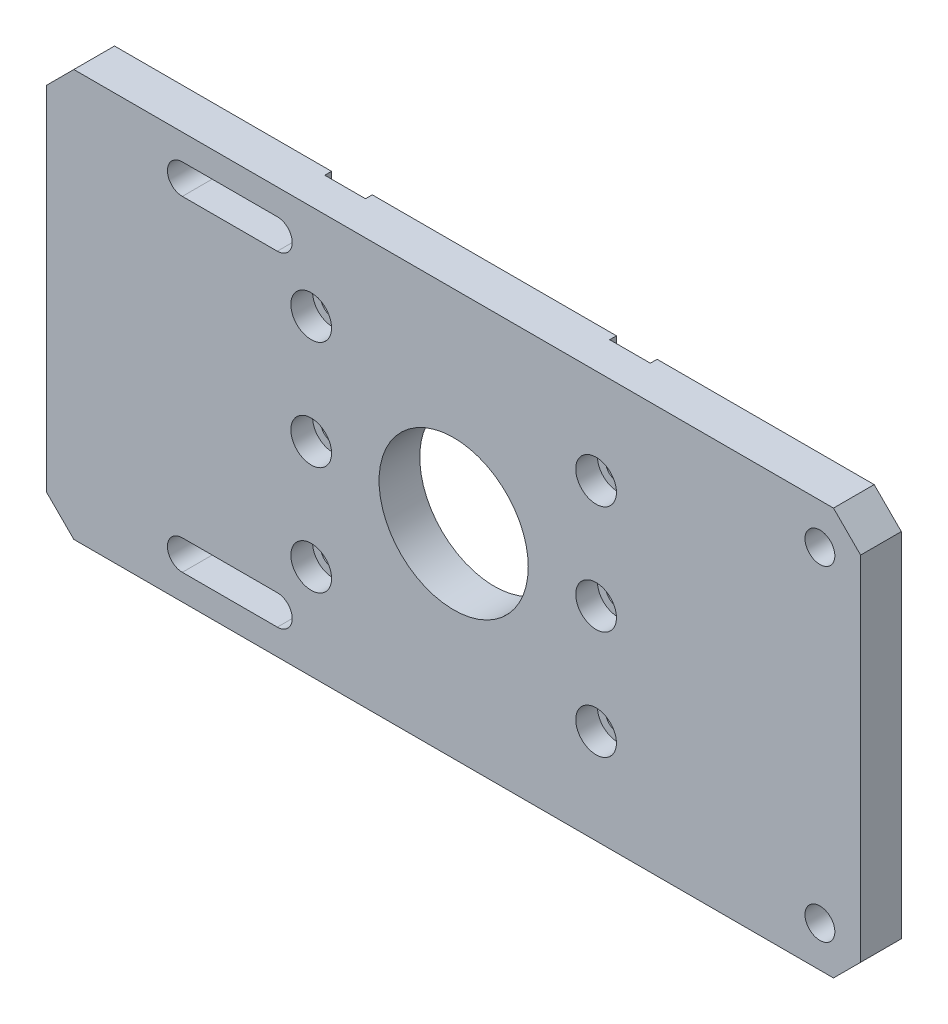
ISO-10303-21;
HEADER;
FILE_DESCRIPTION(('STEP AP214'),'2;1');
FILE_NAME('part.step','',(''),(''),'','','');
FILE_SCHEMA(('AUTOMOTIVE_DESIGN { 1 0 10303 214 1 1 1 1 }'));
ENDSEC;
DATA;
#1=APPLICATION_CONTEXT('core data for automotive mechanical design processes');
#2=APPLICATION_PROTOCOL_DEFINITION('international standard','automotive_design',2000,#1);
#3=PRODUCT_CONTEXT('',#1,'mechanical');
#4=PRODUCT('Part','Part','',(#3));
#5=PRODUCT_RELATED_PRODUCT_CATEGORY('part','',(#4));
#6=PRODUCT_DEFINITION_FORMATION('','',#4);
#7=PRODUCT_DEFINITION_CONTEXT('part definition',#1,'design');
#8=PRODUCT_DEFINITION('design','',#6,#7);
#9=PRODUCT_DEFINITION_SHAPE('','',#8);
#10=(LENGTH_UNIT() NAMED_UNIT(*) SI_UNIT(.MILLI.,.METRE.));
#11=(NAMED_UNIT(*) PLANE_ANGLE_UNIT() SI_UNIT($,.RADIAN.));
#12=(NAMED_UNIT(*) SI_UNIT($,.STERADIAN.) SOLID_ANGLE_UNIT());
#13=UNCERTAINTY_MEASURE_WITH_UNIT(LENGTH_MEASURE(1.E-05),#10,'distance_accuracy_value','');
#14=(GEOMETRIC_REPRESENTATION_CONTEXT(3) GLOBAL_UNCERTAINTY_ASSIGNED_CONTEXT((#13)) GLOBAL_UNIT_ASSIGNED_CONTEXT((#10,
#11,#12)) REPRESENTATION_CONTEXT('',''));
#15=CARTESIAN_POINT('',(0.,0.,0.));
#16=DIRECTION('',(0.,0.,1.));
#17=DIRECTION('',(1.,0.,0.));
#18=AXIS2_PLACEMENT_3D('',#15,#16,#17);
#19=CARTESIAN_POINT('',(150.,75.,0.));
#20=DIRECTION('',(0.,0.,-1.));
#21=DIRECTION('',(-1.,0.,0.));
#22=AXIS2_PLACEMENT_3D('',#19,#20,#21);
#23=PLANE('',#22);
#24=DIRECTION('',(0.,1.,0.));
#25=VECTOR('',#24,1.);
#26=CARTESIAN_POINT('',(45.,75.,0.));
#27=LINE('',#26,#25);
#28=CARTESIAN_POINT('',(45.,-75.,0.));
#29=VERTEX_POINT('',#28);
#30=CARTESIAN_POINT('',(45.,75.,0.));
#31=VERTEX_POINT('',#30);
#32=EDGE_CURVE('E225',#29,#31,#27,.T.);
#33=ORIENTED_EDGE('',*,*,#32,.F.);
#34=DIRECTION('',(1.,0.,0.));
#35=VECTOR('',#34,1.);
#36=CARTESIAN_POINT('',(-140.,-75.,0.));
#37=LINE('',#36,#35);
#38=CARTESIAN_POINT('',(-45.,-75.,0.));
#39=VERTEX_POINT('',#38);
#40=EDGE_CURVE('E458',#39,#29,#37,.T.);
#41=ORIENTED_EDGE('',*,*,#40,.F.);
#42=DIRECTION('',(0.,-1.,0.));
#43=VECTOR('',#42,1.);
#44=CARTESIAN_POINT('',(-45.,75.,0.));
#45=LINE('',#44,#43);
#46=CARTESIAN_POINT('',(-45.,75.,0.));
#47=VERTEX_POINT('',#46);
#48=EDGE_CURVE('E303',#47,#39,#45,.T.);
#49=ORIENTED_EDGE('',*,*,#48,.F.);
#50=DIRECTION('',(-1.,0.,0.));
#51=VECTOR('',#50,1.);
#52=CARTESIAN_POINT('',(-140.,75.,0.));
#53=LINE('',#52,#51);
#54=EDGE_CURVE('E447',#31,#47,#53,.T.);
#55=ORIENTED_EDGE('',*,*,#54,.F.);
#56=EDGE_LOOP('',(#33,#41,#49,#55));
#57=FACE_BOUND('',#56,.T.);
#58=CARTESIAN_POINT('',(0.,0.,0.));
#59=DIRECTION('',(0.,0.,1.));
#60=DIRECTION('',(1.,0.,0.));
#61=AXIS2_PLACEMENT_3D('',#58,#59,#60);
#62=CIRCLE('',#61,27.5);
#63=CARTESIAN_POINT('',(27.5,0.,0.));
#64=VERTEX_POINT('',#63);
#65=EDGE_CURVE('E437',#64,#64,#62,.T.);
#66=ORIENTED_EDGE('',*,*,#65,.T.);
#67=EDGE_LOOP('',(#66));
#68=FACE_BOUND('',#67,.T.);
#69=ADVANCED_FACE('F35',(#57,#68),#23,.T.);
#70=DIRECTION('',(0.,1.,0.));
#71=VECTOR('',#70,1.);
#72=CARTESIAN_POINT('',(-60.,75.,0.));
#73=LINE('',#72,#71);
#74=CARTESIAN_POINT('',(-60.,-75.,0.));
#75=VERTEX_POINT('',#74);
#76=CARTESIAN_POINT('',(-60.,-62.291287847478,0.));
#77=VERTEX_POINT('',#76);
#78=EDGE_CURVE('E297',#75,#77,#73,.T.);
#79=ORIENTED_EDGE('',*,*,#78,.F.);
#80=CARTESIAN_POINT('',(-140.,-75.,0.));
#81=VERTEX_POINT('',#80);
#82=EDGE_CURVE('E454',#81,#75,#37,.T.);
#83=ORIENTED_EDGE('',*,*,#82,.F.);
#84=DIRECTION('',(0.707106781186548,-0.707106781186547,0.));
#85=VECTOR('',#84,1.);
#86=CARTESIAN_POINT('',(-150.,-65.,0.));
#87=LINE('',#86,#85);
#88=CARTESIAN_POINT('',(-150.,-65.,0.));
#89=VERTEX_POINT('',#88);
#90=EDGE_CURVE('E451',#89,#81,#87,.T.);
#91=ORIENTED_EDGE('',*,*,#90,.F.);
#92=DIRECTION('',(0.,-1.,0.));
#93=VECTOR('',#92,1.);
#94=CARTESIAN_POINT('',(-150.,65.,0.));
#95=LINE('',#94,#93);
#96=CARTESIAN_POINT('',(-150.,65.,0.));
#97=VERTEX_POINT('',#96);
#98=EDGE_CURVE('E449',#97,#89,#95,.T.);
#99=ORIENTED_EDGE('',*,*,#98,.F.);
#100=DIRECTION('',(-0.707106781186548,-0.707106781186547,0.));
#101=VECTOR('',#100,1.);
#102=CARTESIAN_POINT('',(-150.,65.,0.));
#103=LINE('',#102,#101);
#104=CARTESIAN_POINT('',(-140.,75.,0.));
#105=VERTEX_POINT('',#104);
#106=EDGE_CURVE('E446',#105,#97,#103,.T.);
#107=ORIENTED_EDGE('',*,*,#106,.F.);
#108=CARTESIAN_POINT('',(-60.,75.,0.));
#109=VERTEX_POINT('',#108);
#110=EDGE_CURVE('E443',#109,#105,#53,.T.);
#111=ORIENTED_EDGE('',*,*,#110,.F.);
#112=CARTESIAN_POINT('',(-60.,62.2912878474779,0.));
#113=VERTEX_POINT('',#112);
#114=EDGE_CURVE('E296',#113,#109,#73,.T.);
#115=ORIENTED_EDGE('',*,*,#114,.F.);
#116=CARTESIAN_POINT('',(-65.,60.,0.));
#117=DIRECTION('',(0.,0.,1.));
#118=DIRECTION('',(1.,0.,0.));
#119=AXIS2_PLACEMENT_3D('',#116,#117,#118);
#120=CIRCLE('',#119,5.49999999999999);
#121=CARTESIAN_POINT('',(-65.,65.5,0.));
#122=VERTEX_POINT('',#121);
#123=EDGE_CURVE('E409',#113,#122,#120,.T.);
#124=ORIENTED_EDGE('',*,*,#123,.T.);
#125=DIRECTION('',(-1.,0.,0.));
#126=VECTOR('',#125,1.);
#127=CARTESIAN_POINT('',(-100.,65.5,0.));
#128=LINE('',#127,#126);
#129=CARTESIAN_POINT('',(-100.,65.5,0.));
#130=VERTEX_POINT('',#129);
#131=EDGE_CURVE('E413',#122,#130,#128,.T.);
#132=ORIENTED_EDGE('',*,*,#131,.T.);
#133=CARTESIAN_POINT('',(-100.,60.,0.));
#134=DIRECTION('',(0.,0.,1.));
#135=DIRECTION('',(1.,0.,0.));
#136=AXIS2_PLACEMENT_3D('',#133,#134,#135);
#137=CIRCLE('',#136,5.5);
#138=CARTESIAN_POINT('',(-100.,54.5,0.));
#139=VERTEX_POINT('',#138);
#140=EDGE_CURVE('E403',#130,#139,#137,.T.);
#141=ORIENTED_EDGE('',*,*,#140,.T.);
#142=DIRECTION('',(1.,0.,0.));
#143=VECTOR('',#142,1.);
#144=CARTESIAN_POINT('',(-65.,54.5,0.));
#145=LINE('',#144,#143);
#146=CARTESIAN_POINT('',(-65.,54.5,0.));
#147=VERTEX_POINT('',#146);
#148=EDGE_CURVE('E406',#139,#147,#145,.T.);
#149=ORIENTED_EDGE('',*,*,#148,.T.);
#150=CARTESIAN_POINT('',(-60.,57.7087121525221,0.));
#151=VERTEX_POINT('',#150);
#152=EDGE_CURVE('E410',#147,#151,#120,.T.);
#153=ORIENTED_EDGE('',*,*,#152,.T.);
#154=CARTESIAN_POINT('',(-60.,-57.7087121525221,0.));
#155=VERTEX_POINT('',#154);
#156=EDGE_CURVE('E293',#155,#151,#73,.T.);
#157=ORIENTED_EDGE('',*,*,#156,.F.);
#158=CARTESIAN_POINT('',(-65.,-60.,0.));
#159=DIRECTION('',(0.,0.,1.));
#160=DIRECTION('',(-1.,0.,0.));
#161=AXIS2_PLACEMENT_3D('',#158,#159,#160);
#162=CIRCLE('',#161,5.5);
#163=CARTESIAN_POINT('',(-65.,-54.5,0.));
#164=VERTEX_POINT('',#163);
#165=EDGE_CURVE('E370',#155,#164,#162,.T.);
#166=ORIENTED_EDGE('',*,*,#165,.T.);
#167=DIRECTION('',(-1.,0.,0.));
#168=VECTOR('',#167,1.);
#169=CARTESIAN_POINT('',(-65.,-54.5,0.));
#170=LINE('',#169,#168);
#171=CARTESIAN_POINT('',(-100.,-54.5,0.));
#172=VERTEX_POINT('',#171);
#173=EDGE_CURVE('E374',#164,#172,#170,.T.);
#174=ORIENTED_EDGE('',*,*,#173,.T.);
#175=CARTESIAN_POINT('',(-100.,-60.,0.));
#176=DIRECTION('',(0.,0.,1.));
#177=DIRECTION('',(-1.,0.,0.));
#178=AXIS2_PLACEMENT_3D('',#175,#176,#177);
#179=CIRCLE('',#178,5.5);
#180=CARTESIAN_POINT('',(-100.,-65.5,0.));
#181=VERTEX_POINT('',#180);
#182=EDGE_CURVE('E377',#172,#181,#179,.T.);
#183=ORIENTED_EDGE('',*,*,#182,.T.);
#184=DIRECTION('',(1.,0.,0.));
#185=VECTOR('',#184,1.);
#186=CARTESIAN_POINT('',(-100.,-65.5,0.));
#187=LINE('',#186,#185);
#188=CARTESIAN_POINT('',(-65.,-65.5,0.));
#189=VERTEX_POINT('',#188);
#190=EDGE_CURVE('E380',#181,#189,#187,.T.);
#191=ORIENTED_EDGE('',*,*,#190,.T.);
#192=EDGE_CURVE('E371',#189,#77,#162,.T.);
#193=ORIENTED_EDGE('',*,*,#192,.T.);
#194=EDGE_LOOP('',(#79,#83,#91,#99,#107,#111,#115,#124,#132,#141,#149,#153,#157,#166,#174,#183,
#191,#193));
#195=FACE_BOUND('',#194,.T.);
#196=ADVANCED_FACE('F577',(#195),#23,.T.);
#197=DIRECTION('',(0.,-1.,0.));
#198=VECTOR('',#197,1.);
#199=CARTESIAN_POINT('',(60.,75.,0.));
#200=LINE('',#199,#198);
#201=CARTESIAN_POINT('',(60.,75.,0.));
#202=VERTEX_POINT('',#201);
#203=CARTESIAN_POINT('',(60.,-75.,0.));
#204=VERTEX_POINT('',#203);
#205=EDGE_CURVE('E255',#202,#204,#200,.T.);
#206=ORIENTED_EDGE('',*,*,#205,.F.);
#207=CARTESIAN_POINT('',(140.,75.,0.));
#208=VERTEX_POINT('',#207);
#209=EDGE_CURVE('E444',#208,#202,#53,.T.);
#210=ORIENTED_EDGE('',*,*,#209,.F.);
#211=DIRECTION('',(-0.707106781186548,0.707106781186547,0.));
#212=VECTOR('',#211,1.);
#213=CARTESIAN_POINT('',(140.,75.,0.));
#214=LINE('',#213,#212);
#215=CARTESIAN_POINT('',(150.,65.,0.));
#216=VERTEX_POINT('',#215);
#217=EDGE_CURVE('E462',#216,#208,#214,.T.);
#218=ORIENTED_EDGE('',*,*,#217,.F.);
#219=DIRECTION('',(0.,1.,0.));
#220=VECTOR('',#219,1.);
#221=CARTESIAN_POINT('',(150.,65.,0.));
#222=LINE('',#221,#220);
#223=CARTESIAN_POINT('',(150.,-65.,0.));
#224=VERTEX_POINT('',#223);
#225=EDGE_CURVE('E460',#224,#216,#222,.T.);
#226=ORIENTED_EDGE('',*,*,#225,.F.);
#227=DIRECTION('',(0.707106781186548,0.707106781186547,0.));
#228=VECTOR('',#227,1.);
#229=CARTESIAN_POINT('',(140.,-75.,0.));
#230=LINE('',#229,#228);
#231=CARTESIAN_POINT('',(140.,-75.,0.));
#232=VERTEX_POINT('',#231);
#233=EDGE_CURVE('E457',#232,#224,#230,.T.);
#234=ORIENTED_EDGE('',*,*,#233,.F.);
#235=EDGE_CURVE('E453',#204,#232,#37,.T.);
#236=ORIENTED_EDGE('',*,*,#235,.F.);
#237=EDGE_LOOP('',(#206,#210,#218,#226,#234,#236));
#238=FACE_BOUND('',#237,.T.);
#239=CARTESIAN_POINT('',(135.,-60.,0.));
#240=DIRECTION('',(0.,0.,1.));
#241=DIRECTION('',(1.,0.,0.));
#242=AXIS2_PLACEMENT_3D('',#239,#240,#241);
#243=CIRCLE('',#242,5.50000000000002);
#244=CARTESIAN_POINT('',(140.5,-60.,0.));
#245=VERTEX_POINT('',#244);
#246=EDGE_CURVE('E428',#245,#245,#243,.T.);
#247=ORIENTED_EDGE('',*,*,#246,.T.);
#248=EDGE_LOOP('',(#247));
#249=FACE_BOUND('',#248,.T.);
#250=CARTESIAN_POINT('',(135.,60.,0.));
#251=DIRECTION('',(0.,0.,1.));
#252=DIRECTION('',(1.,0.,0.));
#253=AXIS2_PLACEMENT_3D('',#250,#251,#252);
#254=CIRCLE('',#253,5.50000000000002);
#255=CARTESIAN_POINT('',(140.5,60.,0.));
#256=VERTEX_POINT('',#255);
#257=EDGE_CURVE('E434',#256,#256,#254,.T.);
#258=ORIENTED_EDGE('',*,*,#257,.T.);
#259=EDGE_LOOP('',(#258));
#260=FACE_BOUND('',#259,.T.);
#261=ADVANCED_FACE('F546',(#238,#249,#260),#23,.T.);
#262=CARTESIAN_POINT('',(150.,75.,15.));
#263=DIRECTION('',(0.,0.,-1.));
#264=DIRECTION('',(-1.,0.,0.));
#265=AXIS2_PLACEMENT_3D('',#262,#263,#264);
#266=PLANE('',#265);
#267=CARTESIAN_POINT('',(52.5,40.,15.));
#268=DIRECTION('',(0.,0.,1.));
#269=DIRECTION('',(1.,0.,0.));
#270=AXIS2_PLACEMENT_3D('',#267,#268,#269);
#271=CIRCLE('',#270,7.5);
#272=CARTESIAN_POINT('',(60.,40.,15.));
#273=VERTEX_POINT('',#272);
#274=EDGE_CURVE('E311',#273,#273,#271,.T.);
#275=ORIENTED_EDGE('',*,*,#274,.F.);
#276=EDGE_LOOP('',(#275));
#277=FACE_BOUND('',#276,.T.);
#278=CARTESIAN_POINT('',(-52.5,39.9999999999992,15.));
#279=DIRECTION('',(0.,0.,1.));
#280=DIRECTION('',(1.,0.,0.));
#281=AXIS2_PLACEMENT_3D('',#278,#279,#280);
#282=CIRCLE('',#281,7.5);
#283=CARTESIAN_POINT('',(-45.,39.9999999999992,15.));
#284=VERTEX_POINT('',#283);
#285=EDGE_CURVE('E320',#284,#284,#282,.T.);
#286=ORIENTED_EDGE('',*,*,#285,.F.);
#287=EDGE_LOOP('',(#286));
#288=FACE_BOUND('',#287,.T.);
#289=CARTESIAN_POINT('',(52.5000000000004,0.,15.));
#290=DIRECTION('',(0.,0.,1.));
#291=DIRECTION('',(1.,0.,0.));
#292=AXIS2_PLACEMENT_3D('',#289,#290,#291);
#293=CIRCLE('',#292,7.5);
#294=CARTESIAN_POINT('',(60.0000000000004,0.,15.));
#295=VERTEX_POINT('',#294);
#296=EDGE_CURVE('E329',#295,#295,#293,.T.);
#297=ORIENTED_EDGE('',*,*,#296,.F.);
#298=EDGE_LOOP('',(#297));
#299=FACE_BOUND('',#298,.T.);
#300=CARTESIAN_POINT('',(-52.4999999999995,-8.04911692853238E-13,15.));
#301=DIRECTION('',(0.,0.,1.));
#302=DIRECTION('',(1.,0.,0.));
#303=AXIS2_PLACEMENT_3D('',#300,#301,#302);
#304=CIRCLE('',#303,7.5);
#305=CARTESIAN_POINT('',(-44.9999999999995,-8.04911692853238E-13,15.));
#306=VERTEX_POINT('',#305);
#307=EDGE_CURVE('E338',#306,#306,#304,.T.);
#308=ORIENTED_EDGE('',*,*,#307,.F.);
#309=EDGE_LOOP('',(#308));
#310=FACE_BOUND('',#309,.T.);
#311=CARTESIAN_POINT('',(52.5000000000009,-40.,15.));
#312=DIRECTION('',(0.,0.,1.));
#313=DIRECTION('',(1.,0.,0.));
#314=AXIS2_PLACEMENT_3D('',#311,#312,#313);
#315=CIRCLE('',#314,7.49999999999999);
#316=CARTESIAN_POINT('',(60.0000000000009,-40.,15.));
#317=VERTEX_POINT('',#316);
#318=EDGE_CURVE('E347',#317,#317,#315,.T.);
#319=ORIENTED_EDGE('',*,*,#318,.F.);
#320=EDGE_LOOP('',(#319));
#321=FACE_BOUND('',#320,.T.);
#322=CARTESIAN_POINT('',(-52.4999999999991,-40.0000000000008,15.));
#323=DIRECTION('',(0.,0.,1.));
#324=DIRECTION('',(1.,0.,0.));
#325=AXIS2_PLACEMENT_3D('',#322,#323,#324);
#326=CIRCLE('',#325,7.49999999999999);
#327=CARTESIAN_POINT('',(-44.9999999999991,-40.0000000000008,15.));
#328=VERTEX_POINT('',#327);
#329=EDGE_CURVE('E356',#328,#328,#326,.T.);
#330=ORIENTED_EDGE('',*,*,#329,.F.);
#331=EDGE_LOOP('',(#330));
#332=FACE_BOUND('',#331,.T.);
#333=DIRECTION('',(-1.,0.,0.));
#334=VECTOR('',#333,1.);
#335=CARTESIAN_POINT('',(-65.,-54.5,15.));
#336=LINE('',#335,#334);
#337=CARTESIAN_POINT('',(-65.,-54.5,15.));
#338=VERTEX_POINT('',#337);
#339=CARTESIAN_POINT('',(-100.,-54.5,15.));
#340=VERTEX_POINT('',#339);
#341=EDGE_CURVE('E361',#338,#340,#336,.T.);
#342=ORIENTED_EDGE('',*,*,#341,.F.);
#343=CARTESIAN_POINT('',(-65.,-60.,15.));
#344=DIRECTION('',(0.,0.,1.));
#345=DIRECTION('',(-1.,0.,0.));
#346=AXIS2_PLACEMENT_3D('',#343,#344,#345);
#347=CIRCLE('',#346,5.5);
#348=CARTESIAN_POINT('',(-65.,-65.5,15.));
#349=VERTEX_POINT('',#348);
#350=EDGE_CURVE('E359',#349,#338,#347,.T.);
#351=ORIENTED_EDGE('',*,*,#350,.F.);
#352=DIRECTION('',(1.,0.,0.));
#353=VECTOR('',#352,1.);
#354=CARTESIAN_POINT('',(-100.,-65.5,15.));
#355=LINE('',#354,#353);
#356=CARTESIAN_POINT('',(-100.,-65.5,15.));
#357=VERTEX_POINT('',#356);
#358=EDGE_CURVE('E367',#357,#349,#355,.T.);
#359=ORIENTED_EDGE('',*,*,#358,.F.);
#360=CARTESIAN_POINT('',(-100.,-60.,15.));
#361=DIRECTION('',(0.,0.,1.));
#362=DIRECTION('',(-1.,0.,0.));
#363=AXIS2_PLACEMENT_3D('',#360,#361,#362);
#364=CIRCLE('',#363,5.5);
#365=EDGE_CURVE('E364',#340,#357,#364,.T.);
#366=ORIENTED_EDGE('',*,*,#365,.F.);
#367=EDGE_LOOP('',(#342,#351,#359,#366));
#368=FACE_BOUND('',#367,.T.);
#369=DIRECTION('',(1.,0.,0.));
#370=VECTOR('',#369,1.);
#371=CARTESIAN_POINT('',(-65.,54.5,15.));
#372=LINE('',#371,#370);
#373=CARTESIAN_POINT('',(-100.,54.5,15.));
#374=VERTEX_POINT('',#373);
#375=CARTESIAN_POINT('',(-65.,54.5,15.));
#376=VERTEX_POINT('',#375);
#377=EDGE_CURVE('E394',#374,#376,#372,.T.);
#378=ORIENTED_EDGE('',*,*,#377,.F.);
#379=CARTESIAN_POINT('',(-100.,60.,15.));
#380=DIRECTION('',(0.,0.,1.));
#381=DIRECTION('',(1.,0.,0.));
#382=AXIS2_PLACEMENT_3D('',#379,#380,#381);
#383=CIRCLE('',#382,5.5);
#384=CARTESIAN_POINT('',(-100.,65.5,15.));
#385=VERTEX_POINT('',#384);
#386=EDGE_CURVE('E386',#385,#374,#383,.T.);
#387=ORIENTED_EDGE('',*,*,#386,.F.);
#388=DIRECTION('',(-1.,0.,0.));
#389=VECTOR('',#388,1.);
#390=CARTESIAN_POINT('',(-100.,65.5,15.));
#391=LINE('',#390,#389);
#392=CARTESIAN_POINT('',(-65.,65.5,15.));
#393=VERTEX_POINT('',#392);
#394=EDGE_CURVE('E400',#393,#385,#391,.T.);
#395=ORIENTED_EDGE('',*,*,#394,.F.);
#396=CARTESIAN_POINT('',(-65.,60.,15.));
#397=DIRECTION('',(0.,0.,1.));
#398=DIRECTION('',(1.,0.,0.));
#399=AXIS2_PLACEMENT_3D('',#396,#397,#398);
#400=CIRCLE('',#399,5.49999999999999);
#401=EDGE_CURVE('E397',#376,#393,#400,.T.);
#402=ORIENTED_EDGE('',*,*,#401,.F.);
#403=EDGE_LOOP('',(#378,#387,#395,#402));
#404=FACE_BOUND('',#403,.T.);
#405=CARTESIAN_POINT('',(135.,-60.,15.));
#406=DIRECTION('',(0.,0.,1.));
#407=DIRECTION('',(1.,0.,0.));
#408=AXIS2_PLACEMENT_3D('',#405,#406,#407);
#409=CIRCLE('',#408,5.50000000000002);
#410=CARTESIAN_POINT('',(140.5,-60.,15.));
#411=VERTEX_POINT('',#410);
#412=EDGE_CURVE('E419',#411,#411,#409,.T.);
#413=ORIENTED_EDGE('',*,*,#412,.F.);
#414=EDGE_LOOP('',(#413));
#415=FACE_BOUND('',#414,.T.);
#416=CARTESIAN_POINT('',(135.,60.,15.));
#417=DIRECTION('',(0.,0.,1.));
#418=DIRECTION('',(1.,0.,0.));
#419=AXIS2_PLACEMENT_3D('',#416,#417,#418);
#420=CIRCLE('',#419,5.50000000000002);
#421=CARTESIAN_POINT('',(140.5,60.,15.));
#422=VERTEX_POINT('',#421);
#423=EDGE_CURVE('E431',#422,#422,#420,.T.);
#424=ORIENTED_EDGE('',*,*,#423,.F.);
#425=EDGE_LOOP('',(#424));
#426=FACE_BOUND('',#425,.T.);
#427=DIRECTION('',(-1.,0.,0.));
#428=VECTOR('',#427,1.);
#429=CARTESIAN_POINT('',(-140.,75.,15.));
#430=LINE('',#429,#428);
#431=CARTESIAN_POINT('',(140.,75.,15.));
#432=VERTEX_POINT('',#431);
#433=CARTESIAN_POINT('',(-140.,75.,15.));
#434=VERTEX_POINT('',#433);
#435=EDGE_CURVE('E464',#432,#434,#430,.T.);
#436=ORIENTED_EDGE('',*,*,#435,.T.);
#437=DIRECTION('',(-0.707106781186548,-0.707106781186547,0.));
#438=VECTOR('',#437,1.);
#439=CARTESIAN_POINT('',(-150.,65.,15.));
#440=LINE('',#439,#438);
#441=CARTESIAN_POINT('',(-150.,65.,15.));
#442=VERTEX_POINT('',#441);
#443=EDGE_CURVE('E467',#434,#442,#440,.T.);
#444=ORIENTED_EDGE('',*,*,#443,.T.);
#445=DIRECTION('',(0.,-1.,0.));
#446=VECTOR('',#445,1.);
#447=CARTESIAN_POINT('',(-150.,65.,15.));
#448=LINE('',#447,#446);
#449=CARTESIAN_POINT('',(-150.,-65.,15.));
#450=VERTEX_POINT('',#449);
#451=EDGE_CURVE('E469',#442,#450,#448,.T.);
#452=ORIENTED_EDGE('',*,*,#451,.T.);
#453=DIRECTION('',(0.707106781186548,-0.707106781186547,0.));
#454=VECTOR('',#453,1.);
#455=CARTESIAN_POINT('',(-150.,-65.,15.));
#456=LINE('',#455,#454);
#457=CARTESIAN_POINT('',(-140.,-75.,15.));
#458=VERTEX_POINT('',#457);
#459=EDGE_CURVE('E471',#450,#458,#456,.T.);
#460=ORIENTED_EDGE('',*,*,#459,.T.);
#461=DIRECTION('',(1.,0.,0.));
#462=VECTOR('',#461,1.);
#463=CARTESIAN_POINT('',(-140.,-75.,15.));
#464=LINE('',#463,#462);
#465=CARTESIAN_POINT('',(140.,-75.,15.));
#466=VERTEX_POINT('',#465);
#467=EDGE_CURVE('E473',#458,#466,#464,.T.);
#468=ORIENTED_EDGE('',*,*,#467,.T.);
#469=DIRECTION('',(0.707106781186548,0.707106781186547,0.));
#470=VECTOR('',#469,1.);
#471=CARTESIAN_POINT('',(140.,-75.,15.));
#472=LINE('',#471,#470);
#473=CARTESIAN_POINT('',(150.,-65.,15.));
#474=VERTEX_POINT('',#473);
#475=EDGE_CURVE('E475',#466,#474,#472,.T.);
#476=ORIENTED_EDGE('',*,*,#475,.T.);
#477=DIRECTION('',(0.,1.,0.));
#478=VECTOR('',#477,1.);
#479=CARTESIAN_POINT('',(150.,65.,15.));
#480=LINE('',#479,#478);
#481=CARTESIAN_POINT('',(150.,65.,15.));
#482=VERTEX_POINT('',#481);
#483=EDGE_CURVE('E477',#474,#482,#480,.T.);
#484=ORIENTED_EDGE('',*,*,#483,.T.);
#485=DIRECTION('',(-0.707106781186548,0.707106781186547,0.));
#486=VECTOR('',#485,1.);
#487=CARTESIAN_POINT('',(140.,75.,15.));
#488=LINE('',#487,#486);
#489=EDGE_CURVE('E479',#482,#432,#488,.T.);
#490=ORIENTED_EDGE('',*,*,#489,.T.);
#491=EDGE_LOOP('',(#436,#444,#452,#460,#468,#476,#484,#490));
#492=FACE_BOUND('',#491,.T.);
#493=CARTESIAN_POINT('',(0.,0.,15.));
#494=DIRECTION('',(0.,0.,1.));
#495=DIRECTION('',(1.,0.,0.));
#496=AXIS2_PLACEMENT_3D('',#493,#494,#495);
#497=CIRCLE('',#496,27.5);
#498=CARTESIAN_POINT('',(27.5,0.,15.));
#499=VERTEX_POINT('',#498);
#500=EDGE_CURVE('E440',#499,#499,#497,.T.);
#501=ORIENTED_EDGE('',*,*,#500,.F.);
#502=EDGE_LOOP('',(#501));
#503=FACE_BOUND('',#502,.T.);
#504=ADVANCED_FACE('F543',(#277,#288,#299,#310,#321,#332,#368,#404,#415,#426,#492,#503),#266,.F.);
#505=CARTESIAN_POINT('',(-140.,75.,15.));
#506=DIRECTION('',(0.,-1.,0.));
#507=DIRECTION('',(0.,0.,-1.));
#508=AXIS2_PLACEMENT_3D('',#505,#506,#507);
#509=PLANE('',#508);
#510=DIRECTION('',(1.,0.,0.));
#511=VECTOR('',#510,1.);
#512=CARTESIAN_POINT('',(45.,75.,2.5));
#513=LINE('',#512,#511);
#514=CARTESIAN_POINT('',(45.,75.,2.5));
#515=VERTEX_POINT('',#514);
#516=CARTESIAN_POINT('',(60.,75.,2.5));
#517=VERTEX_POINT('',#516);
#518=EDGE_CURVE('E229',#515,#517,#513,.T.);
#519=ORIENTED_EDGE('',*,*,#518,.F.);
#520=DIRECTION('',(0.,0.,1.));
#521=VECTOR('',#520,1.);
#522=CARTESIAN_POINT('',(45.,75.,2.5));
#523=LINE('',#522,#521);
#524=EDGE_CURVE('E219',#31,#515,#523,.T.);
#525=ORIENTED_EDGE('',*,*,#524,.F.);
#526=ORIENTED_EDGE('',*,*,#54,.T.);
#527=DIRECTION('',(0.,0.,-1.));
#528=VECTOR('',#527,1.);
#529=CARTESIAN_POINT('',(-45.,75.,2.5));
#530=LINE('',#529,#528);
#531=CARTESIAN_POINT('',(-45.,75.,2.5));
#532=VERTEX_POINT('',#531);
#533=EDGE_CURVE('E263',#532,#47,#530,.T.);
#534=ORIENTED_EDGE('',*,*,#533,.F.);
#535=DIRECTION('',(1.,0.,0.));
#536=VECTOR('',#535,1.);
#537=CARTESIAN_POINT('',(-60.,75.,2.5));
#538=LINE('',#537,#536);
#539=CARTESIAN_POINT('',(-60.,75.,2.5));
#540=VERTEX_POINT('',#539);
#541=EDGE_CURVE('E260',#540,#532,#538,.T.);
#542=ORIENTED_EDGE('',*,*,#541,.F.);
#543=DIRECTION('',(0.,0.,1.));
#544=VECTOR('',#543,1.);
#545=CARTESIAN_POINT('',(-60.,75.,2.5));
#546=LINE('',#545,#544);
#547=EDGE_CURVE('E258',#109,#540,#546,.T.);
#548=ORIENTED_EDGE('',*,*,#547,.F.);
#549=ORIENTED_EDGE('',*,*,#110,.T.);
#550=DIRECTION('',(0.,0.,-1.));
#551=VECTOR('',#550,1.);
#552=CARTESIAN_POINT('',(-140.,75.,15.));
#553=LINE('',#552,#551);
#554=EDGE_CURVE('E502',#434,#105,#553,.T.);
#555=ORIENTED_EDGE('',*,*,#554,.F.);
#556=ORIENTED_EDGE('',*,*,#435,.F.);
#557=DIRECTION('',(0.,0.,-1.));
#558=VECTOR('',#557,1.);
#559=CARTESIAN_POINT('',(140.,75.,15.));
#560=LINE('',#559,#558);
#561=EDGE_CURVE('E481',#432,#208,#560,.T.);
#562=ORIENTED_EDGE('',*,*,#561,.T.);
#563=ORIENTED_EDGE('',*,*,#209,.T.);
#564=DIRECTION('',(0.,0.,-1.));
#565=VECTOR('',#564,1.);
#566=CARTESIAN_POINT('',(60.,75.,2.5));
#567=LINE('',#566,#565);
#568=EDGE_CURVE('E241',#517,#202,#567,.T.);
#569=ORIENTED_EDGE('',*,*,#568,.F.);
#570=EDGE_LOOP('',(#519,#525,#526,#534,#542,#548,#549,#555,#556,#562,#563,#569));
#571=FACE_BOUND('',#570,.T.);
#572=ADVANCED_FACE('F37',(#571),#509,.F.);
#573=CARTESIAN_POINT('',(-150.,65.,15.));
#574=DIRECTION('',(0.707106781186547,-0.707106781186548,0.));
#575=DIRECTION('',(0.707106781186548,0.707106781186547,0.));
#576=AXIS2_PLACEMENT_3D('',#573,#574,#575);
#577=PLANE('',#576);
#578=ORIENTED_EDGE('',*,*,#106,.T.);
#579=DIRECTION('',(0.,0.,-1.));
#580=VECTOR('',#579,1.);
#581=CARTESIAN_POINT('',(-150.,65.,15.));
#582=LINE('',#581,#580);
#583=EDGE_CURVE('E499',#442,#97,#582,.T.);
#584=ORIENTED_EDGE('',*,*,#583,.F.);
#585=ORIENTED_EDGE('',*,*,#443,.F.);
#586=ORIENTED_EDGE('',*,*,#554,.T.);
#587=EDGE_LOOP('',(#578,#584,#585,#586));
#588=FACE_BOUND('',#587,.T.);
#589=ADVANCED_FACE('F733',(#588),#577,.F.);
#590=CARTESIAN_POINT('',(-150.,65.,15.));
#591=DIRECTION('',(1.,0.,0.));
#592=DIRECTION('',(0.,0.,-1.));
#593=AXIS2_PLACEMENT_3D('',#590,#591,#592);
#594=PLANE('',#593);
#595=ORIENTED_EDGE('',*,*,#98,.T.);
#596=DIRECTION('',(0.,0.,-1.));
#597=VECTOR('',#596,1.);
#598=CARTESIAN_POINT('',(-150.,-65.,15.));
#599=LINE('',#598,#597);
#600=EDGE_CURVE('E496',#450,#89,#599,.T.);
#601=ORIENTED_EDGE('',*,*,#600,.F.);
#602=ORIENTED_EDGE('',*,*,#451,.F.);
#603=ORIENTED_EDGE('',*,*,#583,.T.);
#604=EDGE_LOOP('',(#595,#601,#602,#603));
#605=FACE_BOUND('',#604,.T.);
#606=ADVANCED_FACE('F739',(#605),#594,.F.);
#607=CARTESIAN_POINT('',(-150.,-65.,15.));
#608=DIRECTION('',(0.707106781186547,0.707106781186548,0.));
#609=DIRECTION('',(-0.707106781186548,0.707106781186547,0.));
#610=AXIS2_PLACEMENT_3D('',#607,#608,#609);
#611=PLANE('',#610);
#612=ORIENTED_EDGE('',*,*,#90,.T.);
#613=DIRECTION('',(0.,0.,-1.));
#614=VECTOR('',#613,1.);
#615=CARTESIAN_POINT('',(-140.,-75.,15.));
#616=LINE('',#615,#614);
#617=EDGE_CURVE('E493',#458,#81,#616,.T.);
#618=ORIENTED_EDGE('',*,*,#617,.F.);
#619=ORIENTED_EDGE('',*,*,#459,.F.);
#620=ORIENTED_EDGE('',*,*,#600,.T.);
#621=EDGE_LOOP('',(#612,#618,#619,#620));
#622=FACE_BOUND('',#621,.T.);
#623=ADVANCED_FACE('F741',(#622),#611,.F.);
#624=CARTESIAN_POINT('',(-140.,-75.,15.));
#625=DIRECTION('',(0.,1.,0.));
#626=DIRECTION('',(0.,0.,1.));
#627=AXIS2_PLACEMENT_3D('',#624,#625,#626);
#628=PLANE('',#627);
#629=ORIENTED_EDGE('',*,*,#40,.T.);
#630=DIRECTION('',(0.,0.,1.));
#631=VECTOR('',#630,1.);
#632=CARTESIAN_POINT('',(45.,-75.,15.));
#633=LINE('',#632,#631);
#634=CARTESIAN_POINT('',(45.,-75.,2.5));
#635=VERTEX_POINT('',#634);
#636=EDGE_CURVE('E11',#29,#635,#633,.T.);
#637=ORIENTED_EDGE('',*,*,#636,.T.);
#638=DIRECTION('',(1.,0.,0.));
#639=VECTOR('',#638,1.);
#640=CARTESIAN_POINT('',(45.,-75.,2.5));
#641=LINE('',#640,#639);
#642=CARTESIAN_POINT('',(60.,-75.,2.5));
#643=VERTEX_POINT('',#642);
#644=EDGE_CURVE('E237',#635,#643,#641,.T.);
#645=ORIENTED_EDGE('',*,*,#644,.T.);
#646=DIRECTION('',(0.,0.,-1.));
#647=VECTOR('',#646,1.);
#648=CARTESIAN_POINT('',(60.,-75.,2.5));
#649=LINE('',#648,#647);
#650=EDGE_CURVE('E50',#643,#204,#649,.T.);
#651=ORIENTED_EDGE('',*,*,#650,.T.);
#652=ORIENTED_EDGE('',*,*,#235,.T.);
#653=DIRECTION('',(0.,0.,-1.));
#654=VECTOR('',#653,1.);
#655=CARTESIAN_POINT('',(140.,-75.,15.));
#656=LINE('',#655,#654);
#657=EDGE_CURVE('E490',#466,#232,#656,.T.);
#658=ORIENTED_EDGE('',*,*,#657,.F.);
#659=ORIENTED_EDGE('',*,*,#467,.F.);
#660=ORIENTED_EDGE('',*,*,#617,.T.);
#661=ORIENTED_EDGE('',*,*,#82,.T.);
#662=DIRECTION('',(0.,0.,1.));
#663=VECTOR('',#662,1.);
#664=CARTESIAN_POINT('',(-60.,-75.,2.5));
#665=LINE('',#664,#663);
#666=CARTESIAN_POINT('',(-60.,-75.,2.5));
#667=VERTEX_POINT('',#666);
#668=EDGE_CURVE('E266',#75,#667,#665,.T.);
#669=ORIENTED_EDGE('',*,*,#668,.T.);
#670=DIRECTION('',(1.,0.,0.));
#671=VECTOR('',#670,1.);
#672=CARTESIAN_POINT('',(-60.,-75.,2.5));
#673=LINE('',#672,#671);
#674=CARTESIAN_POINT('',(-45.,-75.,2.5));
#675=VERTEX_POINT('',#674);
#676=EDGE_CURVE('E269',#667,#675,#673,.T.);
#677=ORIENTED_EDGE('',*,*,#676,.T.);
#678=DIRECTION('',(0.,0.,-1.));
#679=VECTOR('',#678,1.);
#680=CARTESIAN_POINT('',(-45.,-75.,2.5));
#681=LINE('',#680,#679);
#682=EDGE_CURVE('E272',#675,#39,#681,.T.);
#683=ORIENTED_EDGE('',*,*,#682,.T.);
#684=EDGE_LOOP('',(#629,#637,#645,#651,#652,#658,#659,#660,#661,#669,#677,#683));
#685=FACE_BOUND('',#684,.T.);
#686=ADVANCED_FACE('F715',(#685),#628,.F.);
#687=CARTESIAN_POINT('',(140.,-75.,15.));
#688=DIRECTION('',(-0.707106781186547,0.707106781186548,0.));
#689=DIRECTION('',(-0.707106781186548,-0.707106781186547,0.));
#690=AXIS2_PLACEMENT_3D('',#687,#688,#689);
#691=PLANE('',#690);
#692=ORIENTED_EDGE('',*,*,#233,.T.);
#693=DIRECTION('',(0.,0.,-1.));
#694=VECTOR('',#693,1.);
#695=CARTESIAN_POINT('',(150.,-65.,15.));
#696=LINE('',#695,#694);
#697=EDGE_CURVE('E487',#474,#224,#696,.T.);
#698=ORIENTED_EDGE('',*,*,#697,.F.);
#699=ORIENTED_EDGE('',*,*,#475,.F.);
#700=ORIENTED_EDGE('',*,*,#657,.T.);
#701=EDGE_LOOP('',(#692,#698,#699,#700));
#702=FACE_BOUND('',#701,.T.);
#703=ADVANCED_FACE('F749',(#702),#691,.F.);
#704=CARTESIAN_POINT('',(150.,65.,15.));
#705=DIRECTION('',(-1.,0.,0.));
#706=DIRECTION('',(0.,0.,1.));
#707=AXIS2_PLACEMENT_3D('',#704,#705,#706);
#708=PLANE('',#707);
#709=ORIENTED_EDGE('',*,*,#225,.T.);
#710=DIRECTION('',(0.,0.,-1.));
#711=VECTOR('',#710,1.);
#712=CARTESIAN_POINT('',(150.,65.,15.));
#713=LINE('',#712,#711);
#714=EDGE_CURVE('E484',#482,#216,#713,.T.);
#715=ORIENTED_EDGE('',*,*,#714,.F.);
#716=ORIENTED_EDGE('',*,*,#483,.F.);
#717=ORIENTED_EDGE('',*,*,#697,.T.);
#718=EDGE_LOOP('',(#709,#715,#716,#717));
#719=FACE_BOUND('',#718,.T.);
#720=ADVANCED_FACE('F751',(#719),#708,.F.);
#721=CARTESIAN_POINT('',(140.,75.,15.));
#722=DIRECTION('',(-0.707106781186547,-0.707106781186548,0.));
#723=DIRECTION('',(0.707106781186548,-0.707106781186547,0.));
#724=AXIS2_PLACEMENT_3D('',#721,#722,#723);
#725=PLANE('',#724);
#726=ORIENTED_EDGE('',*,*,#217,.T.);
#727=ORIENTED_EDGE('',*,*,#561,.F.);
#728=ORIENTED_EDGE('',*,*,#489,.F.);
#729=ORIENTED_EDGE('',*,*,#714,.T.);
#730=EDGE_LOOP('',(#726,#727,#728,#729));
#731=FACE_BOUND('',#730,.T.);
#732=ADVANCED_FACE('F572',(#731),#725,.F.);
#733=CARTESIAN_POINT('',(0.,0.,15.));
#734=DIRECTION('',(0.,0.,-1.));
#735=DIRECTION('',(-1.,0.,0.));
#736=AXIS2_PLACEMENT_3D('',#733,#734,#735);
#737=CYLINDRICAL_SURFACE('',#736,27.5);
#738=ORIENTED_EDGE('',*,*,#500,.T.);
#739=EDGE_LOOP('',(#738));
#740=FACE_BOUND('',#739,.T.);
#741=ORIENTED_EDGE('',*,*,#65,.F.);
#742=EDGE_LOOP('',(#741));
#743=FACE_BOUND('',#742,.T.);
#744=ADVANCED_FACE('F568',(#740,#743),#737,.F.);
#745=CARTESIAN_POINT('',(135.,60.,0.));
#746=DIRECTION('',(0.,0.,1.));
#747=DIRECTION('',(1.,0.,0.));
#748=AXIS2_PLACEMENT_3D('',#745,#746,#747);
#749=CYLINDRICAL_SURFACE('',#748,5.50000000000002);
#750=ORIENTED_EDGE('',*,*,#257,.F.);
#751=EDGE_LOOP('',(#750));
#752=FACE_BOUND('',#751,.T.);
#753=ORIENTED_EDGE('',*,*,#423,.T.);
#754=EDGE_LOOP('',(#753));
#755=FACE_BOUND('',#754,.T.);
#756=ADVANCED_FACE('F571',(#752,#755),#749,.F.);
#757=CARTESIAN_POINT('',(135.,-60.,0.));
#758=DIRECTION('',(0.,0.,1.));
#759=DIRECTION('',(1.,0.,0.));
#760=AXIS2_PLACEMENT_3D('',#757,#758,#759);
#761=CYLINDRICAL_SURFACE('',#760,5.50000000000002);
#762=ORIENTED_EDGE('',*,*,#246,.F.);
#763=EDGE_LOOP('',(#762));
#764=FACE_BOUND('',#763,.T.);
#765=ORIENTED_EDGE('',*,*,#412,.T.);
#766=EDGE_LOOP('',(#765));
#767=FACE_BOUND('',#766,.T.);
#768=ADVANCED_FACE('F598',(#764,#767),#761,.F.);
#769=CARTESIAN_POINT('',(-100.,60.,0.));
#770=DIRECTION('',(0.,0.,1.));
#771=DIRECTION('',(1.,0.,0.));
#772=AXIS2_PLACEMENT_3D('',#769,#770,#771);
#773=CYLINDRICAL_SURFACE('',#772,5.5);
#774=ORIENTED_EDGE('',*,*,#386,.T.);
#775=DIRECTION('',(0.,0.,1.));
#776=VECTOR('',#775,1.);
#777=CARTESIAN_POINT('',(-100.,54.5,0.));
#778=LINE('',#777,#776);
#779=EDGE_CURVE('E416',#139,#374,#778,.T.);
#780=ORIENTED_EDGE('',*,*,#779,.F.);
#781=ORIENTED_EDGE('',*,*,#140,.F.);
#782=DIRECTION('',(0.,0.,1.));
#783=VECTOR('',#782,1.);
#784=CARTESIAN_POINT('',(-100.,65.5,0.));
#785=LINE('',#784,#783);
#786=EDGE_CURVE('E417',#130,#385,#785,.T.);
#787=ORIENTED_EDGE('',*,*,#786,.T.);
#788=EDGE_LOOP('',(#774,#780,#781,#787));
#789=FACE_BOUND('',#788,.T.);
#790=ADVANCED_FACE('F603',(#789),#773,.F.);
#791=CARTESIAN_POINT('',(-100.,65.5,0.));
#792=DIRECTION('',(0.,1.,0.));
#793=DIRECTION('',(0.,0.,1.));
#794=AXIS2_PLACEMENT_3D('',#791,#792,#793);
#795=PLANE('',#794);
#796=ORIENTED_EDGE('',*,*,#394,.T.);
#797=ORIENTED_EDGE('',*,*,#786,.F.);
#798=ORIENTED_EDGE('',*,*,#131,.F.);
#799=DIRECTION('',(0.,0.,1.));
#800=VECTOR('',#799,1.);
#801=CARTESIAN_POINT('',(-65.,65.5,0.));
#802=LINE('',#801,#800);
#803=EDGE_CURVE('E420',#122,#393,#802,.T.);
#804=ORIENTED_EDGE('',*,*,#803,.T.);
#805=EDGE_LOOP('',(#796,#797,#798,#804));
#806=FACE_BOUND('',#805,.T.);
#807=ADVANCED_FACE('F609',(#806),#795,.F.);
#808=CARTESIAN_POINT('',(-65.,60.,0.));
#809=DIRECTION('',(0.,0.,1.));
#810=DIRECTION('',(1.,0.,0.));
#811=AXIS2_PLACEMENT_3D('',#808,#809,#810);
#812=CYLINDRICAL_SURFACE('',#811,5.49999999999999);
#813=CARTESIAN_POINT('',(-65.,60.,2.5));
#814=DIRECTION('',(0.,0.,1.));
#815=DIRECTION('',(1.,0.,0.));
#816=AXIS2_PLACEMENT_3D('',#813,#814,#815);
#817=CIRCLE('',#816,5.49999999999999);
#818=CARTESIAN_POINT('',(-60.,62.2912878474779,2.5));
#819=VERTEX_POINT('',#818);
#820=CARTESIAN_POINT('',(-60.,57.7087121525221,2.5));
#821=VERTEX_POINT('',#820);
#822=EDGE_CURVE('E290',#819,#821,#817,.F.);
#823=ORIENTED_EDGE('',*,*,#822,.T.);
#824=DIRECTION('',(0.,0.,1.));
#825=VECTOR('',#824,1.);
#826=CARTESIAN_POINT('',(-60.,57.7087121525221,0.));
#827=LINE('',#826,#825);
#828=EDGE_CURVE('E295',#821,#151,#827,.F.);
#829=ORIENTED_EDGE('',*,*,#828,.T.);
#830=ORIENTED_EDGE('',*,*,#152,.F.);
#831=DIRECTION('',(0.,0.,1.));
#832=VECTOR('',#831,1.);
#833=CARTESIAN_POINT('',(-65.,54.5,0.));
#834=LINE('',#833,#832);
#835=EDGE_CURVE('E422',#147,#376,#834,.T.);
#836=ORIENTED_EDGE('',*,*,#835,.T.);
#837=ORIENTED_EDGE('',*,*,#401,.T.);
#838=ORIENTED_EDGE('',*,*,#803,.F.);
#839=ORIENTED_EDGE('',*,*,#123,.F.);
#840=DIRECTION('',(0.,0.,1.));
#841=VECTOR('',#840,1.);
#842=CARTESIAN_POINT('',(-60.,62.2912878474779,0.));
#843=LINE('',#842,#841);
#844=EDGE_CURVE('E300',#113,#819,#843,.T.);
#845=ORIENTED_EDGE('',*,*,#844,.T.);
#846=EDGE_LOOP('',(#823,#829,#830,#836,#837,#838,#839,#845));
#847=FACE_BOUND('',#846,.T.);
#848=ADVANCED_FACE('F615',(#847),#812,.F.);
#849=CARTESIAN_POINT('',(-65.,54.5,0.));
#850=DIRECTION('',(0.,-1.,0.));
#851=DIRECTION('',(1.,0.,0.));
#852=AXIS2_PLACEMENT_3D('',#849,#850,#851);
#853=PLANE('',#852);
#854=ORIENTED_EDGE('',*,*,#377,.T.);
#855=ORIENTED_EDGE('',*,*,#835,.F.);
#856=ORIENTED_EDGE('',*,*,#148,.F.);
#857=ORIENTED_EDGE('',*,*,#779,.T.);
#858=EDGE_LOOP('',(#854,#855,#856,#857));
#859=FACE_BOUND('',#858,.T.);
#860=ADVANCED_FACE('F611',(#859),#853,.F.);
#861=CARTESIAN_POINT('',(-65.,-60.,0.));
#862=DIRECTION('',(0.,0.,1.));
#863=DIRECTION('',(1.,0.,0.));
#864=AXIS2_PLACEMENT_3D('',#861,#862,#863);
#865=CYLINDRICAL_SURFACE('',#864,5.5);
#866=CARTESIAN_POINT('',(-65.,-60.,2.5));
#867=DIRECTION('',(0.,0.,1.));
#868=DIRECTION('',(1.,0.,0.));
#869=AXIS2_PLACEMENT_3D('',#866,#867,#868);
#870=CIRCLE('',#869,5.5);
#871=CARTESIAN_POINT('',(-60.,-57.7087121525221,2.5));
#872=VERTEX_POINT('',#871);
#873=CARTESIAN_POINT('',(-60.,-62.291287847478,2.5));
#874=VERTEX_POINT('',#873);
#875=EDGE_CURVE('E287',#872,#874,#870,.F.);
#876=ORIENTED_EDGE('',*,*,#875,.T.);
#877=DIRECTION('',(0.,0.,1.));
#878=VECTOR('',#877,1.);
#879=CARTESIAN_POINT('',(-60.,-62.291287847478,0.));
#880=LINE('',#879,#878);
#881=EDGE_CURVE('E43',#874,#77,#880,.F.);
#882=ORIENTED_EDGE('',*,*,#881,.T.);
#883=ORIENTED_EDGE('',*,*,#192,.F.);
#884=DIRECTION('',(0.,0.,1.));
#885=VECTOR('',#884,1.);
#886=CARTESIAN_POINT('',(-65.,-65.5,0.));
#887=LINE('',#886,#885);
#888=EDGE_CURVE('E384',#189,#349,#887,.T.);
#889=ORIENTED_EDGE('',*,*,#888,.T.);
#890=ORIENTED_EDGE('',*,*,#350,.T.);
#891=DIRECTION('',(0.,0.,1.));
#892=VECTOR('',#891,1.);
#893=CARTESIAN_POINT('',(-65.,-54.5,0.));
#894=LINE('',#893,#892);
#895=EDGE_CURVE('E383',#164,#338,#894,.T.);
#896=ORIENTED_EDGE('',*,*,#895,.F.);
#897=ORIENTED_EDGE('',*,*,#165,.F.);
#898=DIRECTION('',(0.,0.,1.));
#899=VECTOR('',#898,1.);
#900=CARTESIAN_POINT('',(-60.,-57.7087121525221,0.));
#901=LINE('',#900,#899);
#902=EDGE_CURVE('E505',#155,#872,#901,.T.);
#903=ORIENTED_EDGE('',*,*,#902,.T.);
#904=EDGE_LOOP('',(#876,#882,#883,#889,#890,#896,#897,#903));
#905=FACE_BOUND('',#904,.T.);
#906=ADVANCED_FACE('F614',(#905),#865,.F.);
#907=CARTESIAN_POINT('',(-100.,-65.5,0.));
#908=DIRECTION('',(0.,-1.,0.));
#909=DIRECTION('',(0.,0.,-1.));
#910=AXIS2_PLACEMENT_3D('',#907,#908,#909);
#911=PLANE('',#910);
#912=ORIENTED_EDGE('',*,*,#358,.T.);
#913=ORIENTED_EDGE('',*,*,#888,.F.);
#914=ORIENTED_EDGE('',*,*,#190,.F.);
#915=DIRECTION('',(0.,0.,1.));
#916=VECTOR('',#915,1.);
#917=CARTESIAN_POINT('',(-100.,-65.5,0.));
#918=LINE('',#917,#916);
#919=EDGE_CURVE('E387',#181,#357,#918,.T.);
#920=ORIENTED_EDGE('',*,*,#919,.T.);
#921=EDGE_LOOP('',(#912,#913,#914,#920));
#922=FACE_BOUND('',#921,.T.);
#923=ADVANCED_FACE('F625',(#922),#911,.F.);
#924=CARTESIAN_POINT('',(-100.,-60.,0.));
#925=DIRECTION('',(0.,0.,1.));
#926=DIRECTION('',(1.,0.,0.));
#927=AXIS2_PLACEMENT_3D('',#924,#925,#926);
#928=CYLINDRICAL_SURFACE('',#927,5.5);
#929=ORIENTED_EDGE('',*,*,#365,.T.);
#930=ORIENTED_EDGE('',*,*,#919,.F.);
#931=ORIENTED_EDGE('',*,*,#182,.F.);
#932=DIRECTION('',(0.,0.,1.));
#933=VECTOR('',#932,1.);
#934=CARTESIAN_POINT('',(-100.,-54.5,0.));
#935=LINE('',#934,#933);
#936=EDGE_CURVE('E389',#172,#340,#935,.T.);
#937=ORIENTED_EDGE('',*,*,#936,.T.);
#938=EDGE_LOOP('',(#929,#930,#931,#937));
#939=FACE_BOUND('',#938,.T.);
#940=ADVANCED_FACE('F631',(#939),#928,.F.);
#941=CARTESIAN_POINT('',(-65.,-54.5,0.));
#942=DIRECTION('',(0.,1.,0.));
#943=DIRECTION('',(-1.,0.,0.));
#944=AXIS2_PLACEMENT_3D('',#941,#942,#943);
#945=PLANE('',#944);
#946=ORIENTED_EDGE('',*,*,#341,.T.);
#947=ORIENTED_EDGE('',*,*,#936,.F.);
#948=ORIENTED_EDGE('',*,*,#173,.F.);
#949=ORIENTED_EDGE('',*,*,#895,.T.);
#950=EDGE_LOOP('',(#946,#947,#948,#949));
#951=FACE_BOUND('',#950,.T.);
#952=ADVANCED_FACE('F627',(#951),#945,.F.);
#953=CARTESIAN_POINT('',(-52.4999999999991,-40.0000000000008,15.));
#954=DIRECTION('',(0.,0.,1.));
#955=DIRECTION('',(1.,0.,0.));
#956=AXIS2_PLACEMENT_3D('',#953,#954,#955);
#957=CYLINDRICAL_SURFACE('',#956,7.49999999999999);
#958=CARTESIAN_POINT('',(-52.4999999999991,-40.0000000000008,7.));
#959=DIRECTION('',(0.,0.,1.));
#960=DIRECTION('',(1.,0.,0.));
#961=AXIS2_PLACEMENT_3D('',#958,#959,#960);
#962=CIRCLE('',#961,7.49999999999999);
#963=CARTESIAN_POINT('',(-44.9999999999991,-40.0000000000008,7.));
#964=VERTEX_POINT('',#963);
#965=EDGE_CURVE('E353',#964,#964,#962,.T.);
#966=ORIENTED_EDGE('',*,*,#965,.F.);
#967=EDGE_LOOP('',(#966));
#968=FACE_BOUND('',#967,.T.);
#969=ORIENTED_EDGE('',*,*,#329,.T.);
#970=EDGE_LOOP('',(#969));
#971=FACE_BOUND('',#970,.T.);
#972=ADVANCED_FACE('F630',(#968,#971),#957,.F.);
#973=CARTESIAN_POINT('',(-47.9999999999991,-40.0000000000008,7.));
#974=DIRECTION('',(0.,0.,-1.));
#975=DIRECTION('',(-1.,0.,0.));
#976=AXIS2_PLACEMENT_3D('',#973,#974,#975);
#977=PLANE('',#976);
#978=CARTESIAN_POINT('',(-52.4999999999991,-40.0000000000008,7.));
#979=DIRECTION('',(0.,0.,1.));
#980=DIRECTION('',(1.,0.,0.));
#981=AXIS2_PLACEMENT_3D('',#978,#979,#980);
#982=CIRCLE('',#981,4.5);
#983=CARTESIAN_POINT('',(-47.9999999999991,-40.0000000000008,7.));
#984=VERTEX_POINT('',#983);
#985=EDGE_CURVE('E350',#984,#984,#982,.T.);
#986=ORIENTED_EDGE('',*,*,#985,.F.);
#987=EDGE_LOOP('',(#986));
#988=FACE_BOUND('',#987,.T.);
#989=ORIENTED_EDGE('',*,*,#965,.T.);
#990=EDGE_LOOP('',(#989));
#991=FACE_BOUND('',#990,.T.);
#992=ADVANCED_FACE('F641',(#988,#991),#977,.F.);
#993=CARTESIAN_POINT('',(-52.4999999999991,-40.0000000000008,15.));
#994=DIRECTION('',(0.,0.,1.));
#995=DIRECTION('',(1.,0.,0.));
#996=AXIS2_PLACEMENT_3D('',#993,#994,#995);
#997=CYLINDRICAL_SURFACE('',#996,4.5);
#998=CARTESIAN_POINT('',(-52.4999999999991,-40.0000000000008,2.5));
#999=DIRECTION('',(0.,0.,1.));
#1000=DIRECTION('',(1.,0.,0.));
#1001=AXIS2_PLACEMENT_3D('',#998,#999,#1000);
#1002=CIRCLE('',#1001,4.5);
#1003=CARTESIAN_POINT('',(-47.9999999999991,-40.0000000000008,2.5));
#1004=VERTEX_POINT('',#1003);
#1005=EDGE_CURVE('E284',#1004,#1004,#1002,.F.);
#1006=ORIENTED_EDGE('',*,*,#1005,.T.);
#1007=EDGE_LOOP('',(#1006));
#1008=FACE_BOUND('',#1007,.T.);
#1009=ORIENTED_EDGE('',*,*,#985,.T.);
#1010=EDGE_LOOP('',(#1009));
#1011=FACE_BOUND('',#1010,.T.);
#1012=ADVANCED_FACE('F539',(#1008,#1011),#997,.F.);
#1013=CARTESIAN_POINT('',(52.5000000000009,-40.,15.));
#1014=DIRECTION('',(0.,0.,1.));
#1015=DIRECTION('',(1.,0.,0.));
#1016=AXIS2_PLACEMENT_3D('',#1013,#1014,#1015);
#1017=CYLINDRICAL_SURFACE('',#1016,7.49999999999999);
#1018=CARTESIAN_POINT('',(52.5000000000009,-40.,7.));
#1019=DIRECTION('',(0.,0.,1.));
#1020=DIRECTION('',(1.,0.,0.));
#1021=AXIS2_PLACEMENT_3D('',#1018,#1019,#1020);
#1022=CIRCLE('',#1021,7.49999999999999);
#1023=CARTESIAN_POINT('',(60.0000000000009,-40.,7.));
#1024=VERTEX_POINT('',#1023);
#1025=EDGE_CURVE('E344',#1024,#1024,#1022,.T.);
#1026=ORIENTED_EDGE('',*,*,#1025,.F.);
#1027=EDGE_LOOP('',(#1026));
#1028=FACE_BOUND('',#1027,.T.);
#1029=ORIENTED_EDGE('',*,*,#318,.T.);
#1030=EDGE_LOOP('',(#1029));
#1031=FACE_BOUND('',#1030,.T.);
#1032=ADVANCED_FACE('F533',(#1028,#1031),#1017,.F.);
#1033=CARTESIAN_POINT('',(57.0000000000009,-40.,7.));
#1034=DIRECTION('',(0.,0.,-1.));
#1035=DIRECTION('',(-1.,0.,0.));
#1036=AXIS2_PLACEMENT_3D('',#1033,#1034,#1035);
#1037=PLANE('',#1036);
#1038=CARTESIAN_POINT('',(52.5000000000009,-40.,7.));
#1039=DIRECTION('',(0.,0.,1.));
#1040=DIRECTION('',(1.,0.,0.));
#1041=AXIS2_PLACEMENT_3D('',#1038,#1039,#1040);
#1042=CIRCLE('',#1041,4.5);
#1043=CARTESIAN_POINT('',(57.0000000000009,-40.,7.));
#1044=VERTEX_POINT('',#1043);
#1045=EDGE_CURVE('E341',#1044,#1044,#1042,.T.);
#1046=ORIENTED_EDGE('',*,*,#1045,.F.);
#1047=EDGE_LOOP('',(#1046));
#1048=FACE_BOUND('',#1047,.T.);
#1049=ORIENTED_EDGE('',*,*,#1025,.T.);
#1050=EDGE_LOOP('',(#1049));
#1051=FACE_BOUND('',#1050,.T.);
#1052=ADVANCED_FACE('F527',(#1048,#1051),#1037,.F.);
#1053=CARTESIAN_POINT('',(52.5000000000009,-40.,15.));
#1054=DIRECTION('',(0.,0.,1.));
#1055=DIRECTION('',(1.,0.,0.));
#1056=AXIS2_PLACEMENT_3D('',#1053,#1054,#1055);
#1057=CYLINDRICAL_SURFACE('',#1056,4.5);
#1058=CARTESIAN_POINT('',(52.5000000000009,-40.,2.5));
#1059=DIRECTION('',(0.,0.,1.));
#1060=DIRECTION('',(1.,0.,0.));
#1061=AXIS2_PLACEMENT_3D('',#1058,#1059,#1060);
#1062=CIRCLE('',#1061,4.5);
#1063=CARTESIAN_POINT('',(57.0000000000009,-40.,2.5));
#1064=VERTEX_POINT('',#1063);
#1065=EDGE_CURVE('E252',#1064,#1064,#1062,.F.);
#1066=ORIENTED_EDGE('',*,*,#1065,.T.);
#1067=EDGE_LOOP('',(#1066));
#1068=FACE_BOUND('',#1067,.T.);
#1069=ORIENTED_EDGE('',*,*,#1045,.T.);
#1070=EDGE_LOOP('',(#1069));
#1071=FACE_BOUND('',#1070,.T.);
#1072=ADVANCED_FACE('F523',(#1068,#1071),#1057,.F.);
#1073=CARTESIAN_POINT('',(-52.4999999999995,-8.04911692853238E-13,15.));
#1074=DIRECTION('',(0.,0.,1.));
#1075=DIRECTION('',(1.,0.,0.));
#1076=AXIS2_PLACEMENT_3D('',#1073,#1074,#1075);
#1077=CYLINDRICAL_SURFACE('',#1076,7.5);
#1078=CARTESIAN_POINT('',(-52.4999999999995,-8.04911692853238E-13,7.));
#1079=DIRECTION('',(0.,0.,1.));
#1080=DIRECTION('',(1.,0.,0.));
#1081=AXIS2_PLACEMENT_3D('',#1078,#1079,#1080);
#1082=CIRCLE('',#1081,7.5);
#1083=CARTESIAN_POINT('',(-44.9999999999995,-8.04911692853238E-13,7.));
#1084=VERTEX_POINT('',#1083);
#1085=EDGE_CURVE('E335',#1084,#1084,#1082,.T.);
#1086=ORIENTED_EDGE('',*,*,#1085,.F.);
#1087=EDGE_LOOP('',(#1086));
#1088=FACE_BOUND('',#1087,.T.);
#1089=ORIENTED_EDGE('',*,*,#307,.T.);
#1090=EDGE_LOOP('',(#1089));
#1091=FACE_BOUND('',#1090,.T.);
#1092=ADVANCED_FACE('F526',(#1088,#1091),#1077,.F.);
#1093=CARTESIAN_POINT('',(-47.9999999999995,-8.04911692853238E-13,7.));
#1094=DIRECTION('',(0.,0.,-1.));
#1095=DIRECTION('',(-1.,0.,0.));
#1096=AXIS2_PLACEMENT_3D('',#1093,#1094,#1095);
#1097=PLANE('',#1096);
#1098=CARTESIAN_POINT('',(-52.4999999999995,-8.04911692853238E-13,7.));
#1099=DIRECTION('',(0.,0.,1.));
#1100=DIRECTION('',(1.,0.,0.));
#1101=AXIS2_PLACEMENT_3D('',#1098,#1099,#1100);
#1102=CIRCLE('',#1101,4.5);
#1103=CARTESIAN_POINT('',(-47.9999999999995,-8.04911692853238E-13,7.));
#1104=VERTEX_POINT('',#1103);
#1105=EDGE_CURVE('E332',#1104,#1104,#1102,.T.);
#1106=ORIENTED_EDGE('',*,*,#1105,.F.);
#1107=EDGE_LOOP('',(#1106));
#1108=FACE_BOUND('',#1107,.T.);
#1109=ORIENTED_EDGE('',*,*,#1085,.T.);
#1110=EDGE_LOOP('',(#1109));
#1111=FACE_BOUND('',#1110,.T.);
#1112=ADVANCED_FACE('F651',(#1108,#1111),#1097,.F.);
#1113=CARTESIAN_POINT('',(-52.4999999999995,-8.04911692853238E-13,15.));
#1114=DIRECTION('',(0.,0.,1.));
#1115=DIRECTION('',(1.,0.,0.));
#1116=AXIS2_PLACEMENT_3D('',#1113,#1114,#1115);
#1117=CYLINDRICAL_SURFACE('',#1116,4.5);
#1118=CARTESIAN_POINT('',(-52.4999999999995,-8.04911692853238E-13,2.5));
#1119=DIRECTION('',(0.,0.,1.));
#1120=DIRECTION('',(1.,0.,0.));
#1121=AXIS2_PLACEMENT_3D('',#1118,#1119,#1120);
#1122=CIRCLE('',#1121,4.5);
#1123=CARTESIAN_POINT('',(-47.9999999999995,-8.04911692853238E-13,2.5));
#1124=VERTEX_POINT('',#1123);
#1125=EDGE_CURVE('E281',#1124,#1124,#1122,.F.);
#1126=ORIENTED_EDGE('',*,*,#1125,.T.);
#1127=EDGE_LOOP('',(#1126));
#1128=FACE_BOUND('',#1127,.T.);
#1129=ORIENTED_EDGE('',*,*,#1105,.T.);
#1130=EDGE_LOOP('',(#1129));
#1131=FACE_BOUND('',#1130,.T.);
#1132=ADVANCED_FACE('F655',(#1128,#1131),#1117,.F.);
#1133=CARTESIAN_POINT('',(52.5000000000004,0.,15.));
#1134=DIRECTION('',(0.,0.,1.));
#1135=DIRECTION('',(1.,0.,0.));
#1136=AXIS2_PLACEMENT_3D('',#1133,#1134,#1135);
#1137=CYLINDRICAL_SURFACE('',#1136,7.5);
#1138=CARTESIAN_POINT('',(52.5000000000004,0.,7.));
#1139=DIRECTION('',(0.,0.,1.));
#1140=DIRECTION('',(1.,0.,0.));
#1141=AXIS2_PLACEMENT_3D('',#1138,#1139,#1140);
#1142=CIRCLE('',#1141,7.5);
#1143=CARTESIAN_POINT('',(60.0000000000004,0.,7.));
#1144=VERTEX_POINT('',#1143);
#1145=EDGE_CURVE('E326',#1144,#1144,#1142,.T.);
#1146=ORIENTED_EDGE('',*,*,#1145,.F.);
#1147=EDGE_LOOP('',(#1146));
#1148=FACE_BOUND('',#1147,.T.);
#1149=ORIENTED_EDGE('',*,*,#296,.T.);
#1150=EDGE_LOOP('',(#1149));
#1151=FACE_BOUND('',#1150,.T.);
#1152=ADVANCED_FACE('F659',(#1148,#1151),#1137,.F.);
#1153=CARTESIAN_POINT('',(57.0000000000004,0.,7.));
#1154=DIRECTION('',(0.,0.,-1.));
#1155=DIRECTION('',(-1.,0.,0.));
#1156=AXIS2_PLACEMENT_3D('',#1153,#1154,#1155);
#1157=PLANE('',#1156);
#1158=CARTESIAN_POINT('',(52.5000000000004,0.,7.));
#1159=DIRECTION('',(0.,0.,1.));
#1160=DIRECTION('',(1.,0.,0.));
#1161=AXIS2_PLACEMENT_3D('',#1158,#1159,#1160);
#1162=CIRCLE('',#1161,4.5);
#1163=CARTESIAN_POINT('',(57.0000000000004,0.,7.));
#1164=VERTEX_POINT('',#1163);
#1165=EDGE_CURVE('E323',#1164,#1164,#1162,.T.);
#1166=ORIENTED_EDGE('',*,*,#1165,.F.);
#1167=EDGE_LOOP('',(#1166));
#1168=FACE_BOUND('',#1167,.T.);
#1169=ORIENTED_EDGE('',*,*,#1145,.T.);
#1170=EDGE_LOOP('',(#1169));
#1171=FACE_BOUND('',#1170,.T.);
#1172=ADVANCED_FACE('F663',(#1168,#1171),#1157,.F.);
#1173=CARTESIAN_POINT('',(52.5000000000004,0.,15.));
#1174=DIRECTION('',(0.,0.,1.));
#1175=DIRECTION('',(1.,0.,0.));
#1176=AXIS2_PLACEMENT_3D('',#1173,#1174,#1175);
#1177=CYLINDRICAL_SURFACE('',#1176,4.5);
#1178=CARTESIAN_POINT('',(52.5000000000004,0.,2.5));
#1179=DIRECTION('',(0.,0.,1.));
#1180=DIRECTION('',(1.,0.,0.));
#1181=AXIS2_PLACEMENT_3D('',#1178,#1179,#1180);
#1182=CIRCLE('',#1181,4.5);
#1183=CARTESIAN_POINT('',(57.0000000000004,0.,2.5));
#1184=VERTEX_POINT('',#1183);
#1185=EDGE_CURVE('E249',#1184,#1184,#1182,.F.);
#1186=ORIENTED_EDGE('',*,*,#1185,.T.);
#1187=EDGE_LOOP('',(#1186));
#1188=FACE_BOUND('',#1187,.T.);
#1189=ORIENTED_EDGE('',*,*,#1165,.T.);
#1190=EDGE_LOOP('',(#1189));
#1191=FACE_BOUND('',#1190,.T.);
#1192=ADVANCED_FACE('F667',(#1188,#1191),#1177,.F.);
#1193=CARTESIAN_POINT('',(-52.5,39.9999999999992,15.));
#1194=DIRECTION('',(0.,0.,1.));
#1195=DIRECTION('',(1.,0.,0.));
#1196=AXIS2_PLACEMENT_3D('',#1193,#1194,#1195);
#1197=CYLINDRICAL_SURFACE('',#1196,7.5);
#1198=CARTESIAN_POINT('',(-52.5,39.9999999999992,7.));
#1199=DIRECTION('',(0.,0.,1.));
#1200=DIRECTION('',(1.,0.,0.));
#1201=AXIS2_PLACEMENT_3D('',#1198,#1199,#1200);
#1202=CIRCLE('',#1201,7.5);
#1203=CARTESIAN_POINT('',(-45.,39.9999999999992,7.));
#1204=VERTEX_POINT('',#1203);
#1205=EDGE_CURVE('E317',#1204,#1204,#1202,.T.);
#1206=ORIENTED_EDGE('',*,*,#1205,.F.);
#1207=EDGE_LOOP('',(#1206));
#1208=FACE_BOUND('',#1207,.T.);
#1209=ORIENTED_EDGE('',*,*,#285,.T.);
#1210=EDGE_LOOP('',(#1209));
#1211=FACE_BOUND('',#1210,.T.);
#1212=ADVANCED_FACE('F671',(#1208,#1211),#1197,.F.);
#1213=CARTESIAN_POINT('',(-48.,39.9999999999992,7.));
#1214=DIRECTION('',(0.,0.,-1.));
#1215=DIRECTION('',(-1.,0.,0.));
#1216=AXIS2_PLACEMENT_3D('',#1213,#1214,#1215);
#1217=PLANE('',#1216);
#1218=CARTESIAN_POINT('',(-52.5,39.9999999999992,7.));
#1219=DIRECTION('',(0.,0.,1.));
#1220=DIRECTION('',(1.,0.,0.));
#1221=AXIS2_PLACEMENT_3D('',#1218,#1219,#1220);
#1222=CIRCLE('',#1221,4.5);
#1223=CARTESIAN_POINT('',(-48.,39.9999999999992,7.));
#1224=VERTEX_POINT('',#1223);
#1225=EDGE_CURVE('E314',#1224,#1224,#1222,.T.);
#1226=ORIENTED_EDGE('',*,*,#1225,.F.);
#1227=EDGE_LOOP('',(#1226));
#1228=FACE_BOUND('',#1227,.T.);
#1229=ORIENTED_EDGE('',*,*,#1205,.T.);
#1230=EDGE_LOOP('',(#1229));
#1231=FACE_BOUND('',#1230,.T.);
#1232=ADVANCED_FACE('F675',(#1228,#1231),#1217,.F.);
#1233=CARTESIAN_POINT('',(-52.5,39.9999999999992,15.));
#1234=DIRECTION('',(0.,0.,1.));
#1235=DIRECTION('',(1.,0.,0.));
#1236=AXIS2_PLACEMENT_3D('',#1233,#1234,#1235);
#1237=CYLINDRICAL_SURFACE('',#1236,4.5);
#1238=CARTESIAN_POINT('',(-52.5,39.9999999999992,2.5));
#1239=DIRECTION('',(0.,0.,1.));
#1240=DIRECTION('',(1.,0.,0.));
#1241=AXIS2_PLACEMENT_3D('',#1238,#1239,#1240);
#1242=CIRCLE('',#1241,4.5);
#1243=CARTESIAN_POINT('',(-48.,39.9999999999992,2.5));
#1244=VERTEX_POINT('',#1243);
#1245=EDGE_CURVE('E278',#1244,#1244,#1242,.F.);
#1246=ORIENTED_EDGE('',*,*,#1245,.T.);
#1247=EDGE_LOOP('',(#1246));
#1248=FACE_BOUND('',#1247,.T.);
#1249=ORIENTED_EDGE('',*,*,#1225,.T.);
#1250=EDGE_LOOP('',(#1249));
#1251=FACE_BOUND('',#1250,.T.);
#1252=ADVANCED_FACE('F679',(#1248,#1251),#1237,.F.);
#1253=CARTESIAN_POINT('',(52.5,40.,15.));
#1254=DIRECTION('',(0.,0.,1.));
#1255=DIRECTION('',(1.,0.,0.));
#1256=AXIS2_PLACEMENT_3D('',#1253,#1254,#1255);
#1257=CYLINDRICAL_SURFACE('',#1256,7.5);
#1258=CARTESIAN_POINT('',(52.5,40.,7.));
#1259=DIRECTION('',(0.,0.,1.));
#1260=DIRECTION('',(1.,0.,0.));
#1261=AXIS2_PLACEMENT_3D('',#1258,#1259,#1260);
#1262=CIRCLE('',#1261,7.5);
#1263=CARTESIAN_POINT('',(60.,40.,7.));
#1264=VERTEX_POINT('',#1263);
#1265=EDGE_CURVE('E308',#1264,#1264,#1262,.T.);
#1266=ORIENTED_EDGE('',*,*,#1265,.F.);
#1267=EDGE_LOOP('',(#1266));
#1268=FACE_BOUND('',#1267,.T.);
#1269=ORIENTED_EDGE('',*,*,#274,.T.);
#1270=EDGE_LOOP('',(#1269));
#1271=FACE_BOUND('',#1270,.T.);
#1272=ADVANCED_FACE('F683',(#1268,#1271),#1257,.F.);
#1273=CARTESIAN_POINT('',(57.,40.,7.));
#1274=DIRECTION('',(0.,0.,-1.));
#1275=DIRECTION('',(-1.,0.,0.));
#1276=AXIS2_PLACEMENT_3D('',#1273,#1274,#1275);
#1277=PLANE('',#1276);
#1278=CARTESIAN_POINT('',(52.5,40.,7.));
#1279=DIRECTION('',(0.,0.,1.));
#1280=DIRECTION('',(1.,0.,0.));
#1281=AXIS2_PLACEMENT_3D('',#1278,#1279,#1280);
#1282=CIRCLE('',#1281,4.5);
#1283=CARTESIAN_POINT('',(57.,40.,7.));
#1284=VERTEX_POINT('',#1283);
#1285=EDGE_CURVE('E305',#1284,#1284,#1282,.T.);
#1286=ORIENTED_EDGE('',*,*,#1285,.F.);
#1287=EDGE_LOOP('',(#1286));
#1288=FACE_BOUND('',#1287,.T.);
#1289=ORIENTED_EDGE('',*,*,#1265,.T.);
#1290=EDGE_LOOP('',(#1289));
#1291=FACE_BOUND('',#1290,.T.);
#1292=ADVANCED_FACE('F687',(#1288,#1291),#1277,.F.);
#1293=CARTESIAN_POINT('',(52.5,40.,15.));
#1294=DIRECTION('',(0.,0.,1.));
#1295=DIRECTION('',(1.,0.,0.));
#1296=AXIS2_PLACEMENT_3D('',#1293,#1294,#1295);
#1297=CYLINDRICAL_SURFACE('',#1296,4.5);
#1298=CARTESIAN_POINT('',(52.5,40.,2.5));
#1299=DIRECTION('',(0.,0.,1.));
#1300=DIRECTION('',(1.,0.,0.));
#1301=AXIS2_PLACEMENT_3D('',#1298,#1299,#1300);
#1302=CIRCLE('',#1301,4.5);
#1303=CARTESIAN_POINT('',(57.,40.,2.5));
#1304=VERTEX_POINT('',#1303);
#1305=EDGE_CURVE('E247',#1304,#1304,#1302,.F.);
#1306=ORIENTED_EDGE('',*,*,#1305,.T.);
#1307=EDGE_LOOP('',(#1306));
#1308=FACE_BOUND('',#1307,.T.);
#1309=ORIENTED_EDGE('',*,*,#1285,.T.);
#1310=EDGE_LOOP('',(#1309));
#1311=FACE_BOUND('',#1310,.T.);
#1312=ADVANCED_FACE('F514',(#1308,#1311),#1297,.F.);
#1313=CARTESIAN_POINT('',(-60.,-75.,2.5));
#1314=DIRECTION('',(-1.,0.,0.));
#1315=DIRECTION('',(0.,0.,1.));
#1316=AXIS2_PLACEMENT_3D('',#1313,#1314,#1315);
#1317=PLANE('',#1316);
#1318=ORIENTED_EDGE('',*,*,#114,.T.);
#1319=ORIENTED_EDGE('',*,*,#547,.T.);
#1320=DIRECTION('',(0.,1.,0.));
#1321=VECTOR('',#1320,1.);
#1322=CARTESIAN_POINT('',(-60.,-75.,2.5));
#1323=LINE('',#1322,#1321);
#1324=EDGE_CURVE('E275',#819,#540,#1323,.T.);
#1325=ORIENTED_EDGE('',*,*,#1324,.F.);
#1326=ORIENTED_EDGE('',*,*,#844,.F.);
#1327=EDGE_LOOP('',(#1318,#1319,#1325,#1326));
#1328=FACE_BOUND('',#1327,.T.);
#1329=ADVANCED_FACE('F694',(#1328),#1317,.F.);
#1330=EDGE_CURVE('E280',#872,#821,#1323,.T.);
#1331=ORIENTED_EDGE('',*,*,#1330,.F.);
#1332=ORIENTED_EDGE('',*,*,#902,.F.);
#1333=ORIENTED_EDGE('',*,*,#156,.T.);
#1334=ORIENTED_EDGE('',*,*,#828,.F.);
#1335=EDGE_LOOP('',(#1331,#1332,#1333,#1334));
#1336=FACE_BOUND('',#1335,.T.);
#1337=ADVANCED_FACE('F700',(#1336),#1317,.F.);
#1338=CARTESIAN_POINT('',(-60.,-75.,2.5));
#1339=DIRECTION('',(0.,0.,1.));
#1340=DIRECTION('',(1.,0.,0.));
#1341=AXIS2_PLACEMENT_3D('',#1338,#1339,#1340);
#1342=PLANE('',#1341);
#1343=ORIENTED_EDGE('',*,*,#1125,.F.);
#1344=EDGE_LOOP('',(#1343));
#1345=FACE_BOUND('',#1344,.T.);
#1346=ORIENTED_EDGE('',*,*,#1245,.F.);
#1347=EDGE_LOOP('',(#1346));
#1348=FACE_BOUND('',#1347,.T.);
#1349=ORIENTED_EDGE('',*,*,#1005,.F.);
#1350=EDGE_LOOP('',(#1349));
#1351=FACE_BOUND('',#1350,.T.);
#1352=ORIENTED_EDGE('',*,*,#1324,.T.);
#1353=ORIENTED_EDGE('',*,*,#541,.T.);
#1354=DIRECTION('',(0.,1.,0.));
#1355=VECTOR('',#1354,1.);
#1356=CARTESIAN_POINT('',(-45.,-75.,2.5));
#1357=LINE('',#1356,#1355);
#1358=EDGE_CURVE('E276',#675,#532,#1357,.T.);
#1359=ORIENTED_EDGE('',*,*,#1358,.F.);
#1360=ORIENTED_EDGE('',*,*,#676,.F.);
#1361=EDGE_CURVE('E58',#667,#874,#1323,.T.);
#1362=ORIENTED_EDGE('',*,*,#1361,.T.);
#1363=ORIENTED_EDGE('',*,*,#875,.F.);
#1364=ORIENTED_EDGE('',*,*,#1330,.T.);
#1365=ORIENTED_EDGE('',*,*,#822,.F.);
#1366=EDGE_LOOP('',(#1352,#1353,#1359,#1360,#1362,#1363,#1364,#1365));
#1367=FACE_BOUND('',#1366,.T.);
#1368=ADVANCED_FACE('F698',(#1345,#1348,#1351,#1367),#1342,.F.);
#1369=ORIENTED_EDGE('',*,*,#78,.T.);
#1370=ORIENTED_EDGE('',*,*,#881,.F.);
#1371=ORIENTED_EDGE('',*,*,#1361,.F.);
#1372=ORIENTED_EDGE('',*,*,#668,.F.);
#1373=EDGE_LOOP('',(#1369,#1370,#1371,#1372));
#1374=FACE_BOUND('',#1373,.T.);
#1375=ADVANCED_FACE('F695',(#1374),#1317,.F.);
#1376=CARTESIAN_POINT('',(-45.,-75.,2.5));
#1377=DIRECTION('',(1.,0.,0.));
#1378=DIRECTION('',(0.,0.,-1.));
#1379=AXIS2_PLACEMENT_3D('',#1376,#1377,#1378);
#1380=PLANE('',#1379);
#1381=ORIENTED_EDGE('',*,*,#48,.T.);
#1382=ORIENTED_EDGE('',*,*,#682,.F.);
#1383=ORIENTED_EDGE('',*,*,#1358,.T.);
#1384=ORIENTED_EDGE('',*,*,#533,.T.);
#1385=EDGE_LOOP('',(#1381,#1382,#1383,#1384));
#1386=FACE_BOUND('',#1385,.T.);
#1387=ADVANCED_FACE('F518',(#1386),#1380,.F.);
#1388=CARTESIAN_POINT('',(45.,-75.,2.5));
#1389=DIRECTION('',(0.,0.,1.));
#1390=DIRECTION('',(1.,0.,0.));
#1391=AXIS2_PLACEMENT_3D('',#1388,#1389,#1390);
#1392=PLANE('',#1391);
#1393=ORIENTED_EDGE('',*,*,#1185,.F.);
#1394=EDGE_LOOP('',(#1393));
#1395=FACE_BOUND('',#1394,.T.);
#1396=DIRECTION('',(0.,1.,0.));
#1397=VECTOR('',#1396,1.);
#1398=CARTESIAN_POINT('',(60.,-75.,2.5));
#1399=LINE('',#1398,#1397);
#1400=EDGE_CURVE('E238',#643,#517,#1399,.T.);
#1401=ORIENTED_EDGE('',*,*,#1400,.F.);
#1402=ORIENTED_EDGE('',*,*,#644,.F.);
#1403=DIRECTION('',(0.,1.,0.));
#1404=VECTOR('',#1403,1.);
#1405=CARTESIAN_POINT('',(45.,-75.,2.5));
#1406=LINE('',#1405,#1404);
#1407=EDGE_CURVE('E222',#635,#515,#1406,.T.);
#1408=ORIENTED_EDGE('',*,*,#1407,.T.);
#1409=ORIENTED_EDGE('',*,*,#518,.T.);
#1410=EDGE_LOOP('',(#1401,#1402,#1408,#1409));
#1411=FACE_BOUND('',#1410,.T.);
#1412=ORIENTED_EDGE('',*,*,#1305,.F.);
#1413=EDGE_LOOP('',(#1412));
#1414=FACE_BOUND('',#1413,.T.);
#1415=ORIENTED_EDGE('',*,*,#1065,.F.);
#1416=EDGE_LOOP('',(#1415));
#1417=FACE_BOUND('',#1416,.T.);
#1418=ADVANCED_FACE('F233',(#1395,#1411,#1414,#1417),#1392,.F.);
#1419=CARTESIAN_POINT('',(45.,-75.,2.5));
#1420=DIRECTION('',(-1.,0.,0.));
#1421=DIRECTION('',(0.,0.,1.));
#1422=AXIS2_PLACEMENT_3D('',#1419,#1420,#1421);
#1423=PLANE('',#1422);
#1424=ORIENTED_EDGE('',*,*,#32,.T.);
#1425=ORIENTED_EDGE('',*,*,#524,.T.);
#1426=ORIENTED_EDGE('',*,*,#1407,.F.);
#1427=ORIENTED_EDGE('',*,*,#636,.F.);
#1428=EDGE_LOOP('',(#1424,#1425,#1426,#1427));
#1429=FACE_BOUND('',#1428,.T.);
#1430=ADVANCED_FACE('F221',(#1429),#1423,.F.);
#1431=CARTESIAN_POINT('',(60.,-75.,2.5));
#1432=DIRECTION('',(1.,0.,0.));
#1433=DIRECTION('',(0.,0.,-1.));
#1434=AXIS2_PLACEMENT_3D('',#1431,#1432,#1433);
#1435=PLANE('',#1434);
#1436=ORIENTED_EDGE('',*,*,#205,.T.);
#1437=ORIENTED_EDGE('',*,*,#650,.F.);
#1438=ORIENTED_EDGE('',*,*,#1400,.T.);
#1439=ORIENTED_EDGE('',*,*,#568,.T.);
#1440=EDGE_LOOP('',(#1436,#1437,#1438,#1439));
#1441=FACE_BOUND('',#1440,.T.);
#1442=ADVANCED_FACE('F708',(#1441),#1435,.F.);
#1443=CLOSED_SHELL('',(#69,#196,#261,#504,#572,#589,#606,#623,#686,#703,#720,#732,#744,#756,
#768,#790,#807,#848,#860,#906,#923,#940,#952,#972,#992,#1012,#1032,#1052,#1072,#1092,#1112,
#1132,#1152,#1172,#1192,#1212,#1232,#1252,#1272,#1292,#1312,#1329,#1337,#1368,#1375,#1387,#1418,
#1430,#1442));
#1444=MANIFOLD_SOLID_BREP('B2',#1443);
#1445=ADVANCED_BREP_SHAPE_REPRESENTATION('',(#18,#1444),#14);
#1446=SHAPE_DEFINITION_REPRESENTATION(#9,#1445);
ENDSEC;
END-ISO-10303-21;
